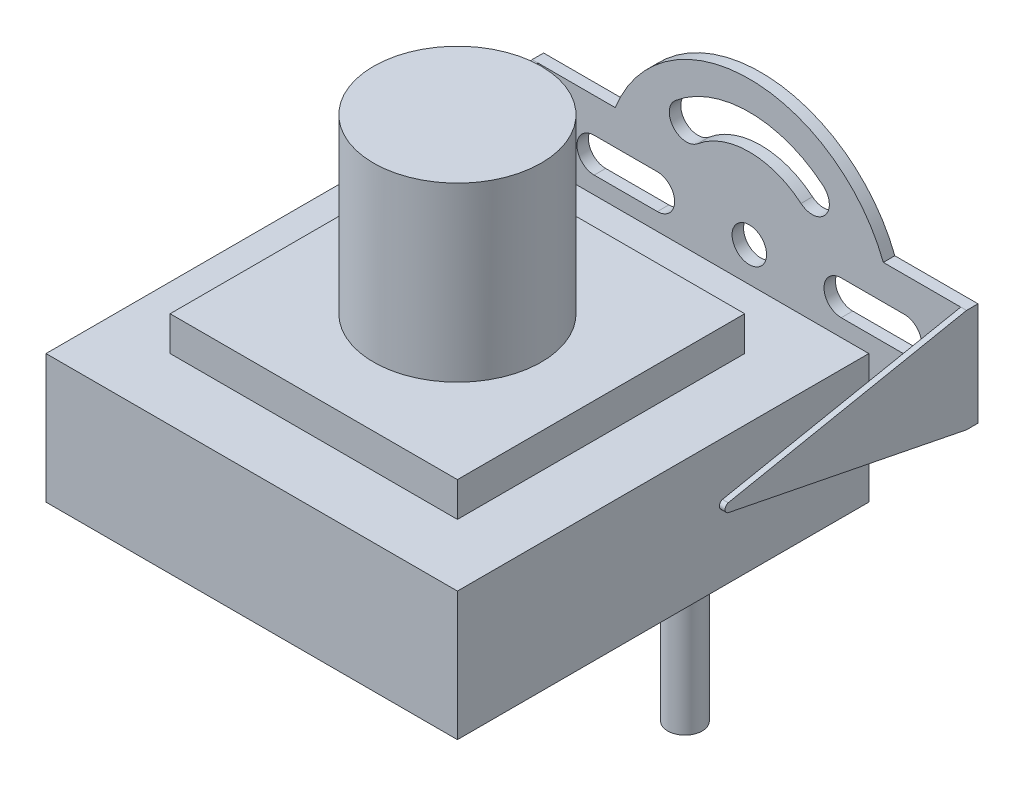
from build123d import *

# Parameters (mm, degrees)
SKETCH_1_W      = 35.8
SKETCH_1_H      = 35.8
EXTRUDE_1_DEPTH = 11.2
SKETCH_2_W      = 25
SKETCH_2_H      = 25
EXTRUDE_2_DEPTH = 3
SKETCH_3_R      = 7.3
EXTRUDE_3_DEPTH = 15
SKETCH_6_R      = 1.5
EXTRUDE_6_DEPTH = 20
SKETCH_8_R      = 1.5
EXTRUDE_8_DEPTH = 1
EXTRUDE_9_DEPTH = 0.5


with BuildPart() as part:
    # Sketch 1 → Extrude 1 (new body)
    with BuildSketch(Plane(origin=(0, 0, 0), x_dir=(1, 0, 0), z_dir=(0, 1, 0))):
        Rectangle(SKETCH_1_W, SKETCH_1_H)
    extrude(amount=EXTRUDE_1_DEPTH)

    # Sketch 2 → Extrude 2 (add)
    with BuildSketch(Plane(origin=(0, 11.2, 0), x_dir=(1, 0, 0), z_dir=(0, 1, 0))):
        Rectangle(SKETCH_2_W, SKETCH_2_H)
    extrude(amount=EXTRUDE_2_DEPTH)

    # Sketch 3 → Extrude 3 (add)
    with BuildSketch(Plane(origin=(0, 14.2, 0), x_dir=(1, 0, 0), z_dir=(0, 1, 0))):
        with Locations(Location((0, 0, 0), (0, 0, 90))):
            Circle(SKETCH_3_R)
    extrude(amount=EXTRUDE_3_DEPTH)

    # Sketch 6 → Extrude 6 (add)
    with BuildSketch(Plane.XZ):
        with Locations(Location((6.4, -13.4, 0), (0, 0, 270))):
            Circle(SKETCH_6_R)
    extrude(amount=EXTRUDE_6_DEPTH)


with BuildPart() as body_2:
    # Sketch 8 → Extrude 8 (new body)
    with BuildSketch(Plane(origin=(0, 0, -25.4), x_dir=(-1, 0, 0), z_dir=(0, 0, -1))):
        with BuildLine():
            Line((18.4, 11.2), (11.66190379, 11.2))
            ThreePointArc((11.66190379, 11.2), (0, 19.2), (-11.66190379, 11.2))
            Line((-11.66190379, 11.2), (-18.4, 11.2))
            Line((-18.4, 11.2), (-18.4, 2.2))
            Line((-18.4, 2.2), (-11.66190379, 2.2))
            ThreePointArc((-11.66190379, 2.2), (0, -5.8), (11.66190379, 2.2))
            Line((11.66190379, 2.2), (18.4, 2.2))
            Line((18.4, 2.2), (18.4, 11.2))
        make_face()
        with Locations((0, 6.7)):
            Circle(SKETCH_8_R, mode=Mode.SUBTRACT)
        with BuildLine():
            Line((8, 8.2), (13.5, 8.2))
            ThreePointArc((13.5, 8.2), (15, 6.7), (13.5, 5.2))
            Line((13.5, 5.2), (8, 5.2))
            ThreePointArc((8, 5.2), (6.5, 6.7), (8, 8.2))
        make_face(mode=Mode.SUBTRACT)
        with BuildLine():
            Line((-8, 8.2), (-13.5, 8.2))
            ThreePointArc((-13.5, 8.2), (-15, 6.7), (-13.5, 5.2))
            Line((-13.5, 5.2), (-8, 5.2))
            ThreePointArc((-8, 5.2), (-6.5, 6.7), (-8, 8.2))
        make_face(mode=Mode.SUBTRACT)
        with BuildLine():
            ThreePointArc((6.427876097, 14.360444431), (0, 16.7), (-6.427876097, 14.360444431))
            ThreePointArc((-6.427876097, 14.360444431), (-6.612761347, 12.247196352), (-4.499513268, 12.062311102))
            ThreePointArc((-4.499513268, 12.062311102), (0, 13.7), (4.499513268, 12.062311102))
            ThreePointArc((4.499513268, 12.062311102), (6.612761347, 12.247196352), (6.427876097, 14.360444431))
        make_face(mode=Mode.SUBTRACT)
        with BuildLine():
            ThreePointArc((6.427876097, -0.960444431), (0, -3.3), (-6.427876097, -0.960444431))
            ThreePointArc((-6.427876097, -0.960444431), (-6.612761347, 1.152803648), (-4.499513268, 1.337688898))
            ThreePointArc((-4.499513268, 1.337688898), (0, -0.3), (4.499513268, 1.337688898))
            ThreePointArc((4.499513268, 1.337688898), (6.612761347, 1.152803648), (6.427876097, -0.960444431))
        make_face(mode=Mode.SUBTRACT)
    extrude(amount=EXTRUDE_8_DEPTH)

    # Sketch 9 → Extrude 9 (add)
    with BuildSketch(Plane.ZY.offset(18.4)):
        with BuildLine():
            Line((-25.4, 11.2), (-4.659980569, 7.074929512))
            ThreePointArc((-4.659980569, 7.074929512), (-4.390597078, 6.7), (-4.659980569, 6.325070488))
            Line((-4.659980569, 6.325070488), (-25.4, 2.2))
            Line((-25.4, 2.2), (-26.4, 2.2))
            Line((-26.4, 2.2), (-26.4, 11.2))
            Line((-26.4, 11.2), (-25.4, 11.2))
        make_face()
    extrude_9 = extrude(amount=EXTRUDE_9_DEPTH)

    # Mirror 2: Extrude 9 across plane
    add(extrude_9.mirror(Plane(origin=(0, 0, 0), x_dir=(0, 0, 1), z_dir=(1, 0, 0))))


solid = Compound([part.part, body_2.part])
